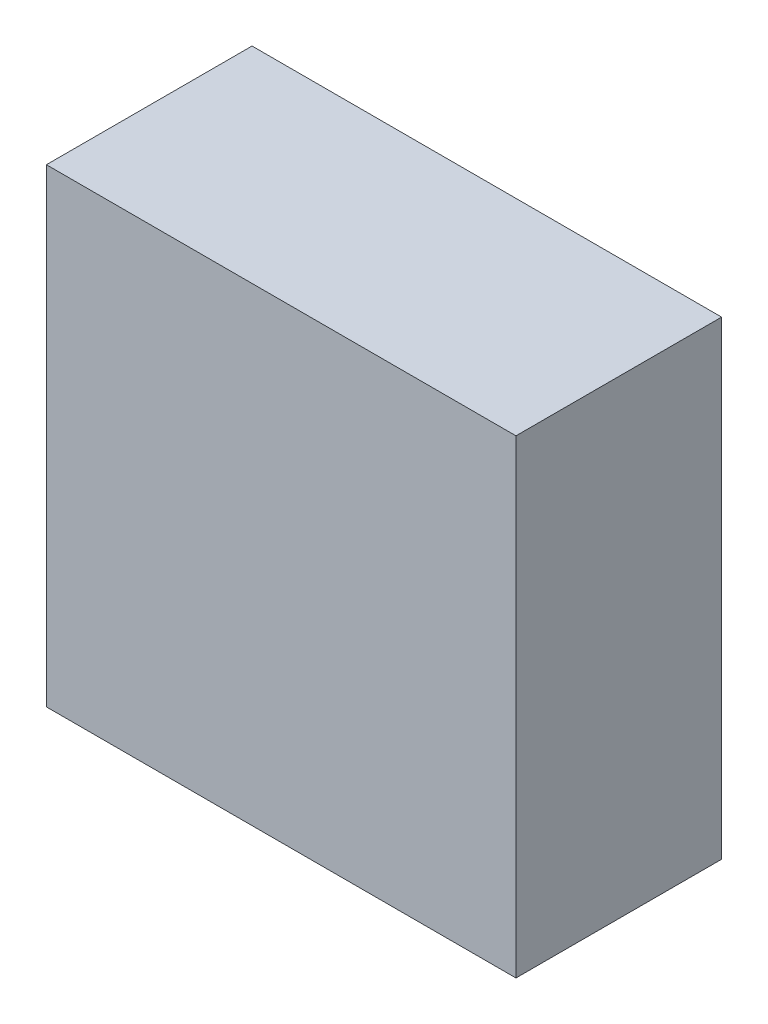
ISO-10303-21;
HEADER;
FILE_DESCRIPTION(('STEP AP214'),'2;1');
FILE_NAME('part.step','',(''),(''),'','','');
FILE_SCHEMA(('AUTOMOTIVE_DESIGN { 1 0 10303 214 1 1 1 1 }'));
ENDSEC;
DATA;
#1=APPLICATION_CONTEXT('core data for automotive mechanical design processes');
#2=APPLICATION_PROTOCOL_DEFINITION('international standard','automotive_design',2000,#1);
#3=PRODUCT_CONTEXT('',#1,'mechanical');
#4=PRODUCT('Part','Part','',(#3));
#5=PRODUCT_RELATED_PRODUCT_CATEGORY('part','',(#4));
#6=PRODUCT_DEFINITION_FORMATION('','',#4);
#7=PRODUCT_DEFINITION_CONTEXT('part definition',#1,'design');
#8=PRODUCT_DEFINITION('design','',#6,#7);
#9=PRODUCT_DEFINITION_SHAPE('','',#8);
#10=(LENGTH_UNIT() NAMED_UNIT(*) SI_UNIT(.MILLI.,.METRE.));
#11=(NAMED_UNIT(*) PLANE_ANGLE_UNIT() SI_UNIT($,.RADIAN.));
#12=(NAMED_UNIT(*) SI_UNIT($,.STERADIAN.) SOLID_ANGLE_UNIT());
#13=UNCERTAINTY_MEASURE_WITH_UNIT(LENGTH_MEASURE(1.E-05),#10,'distance_accuracy_value','');
#14=(GEOMETRIC_REPRESENTATION_CONTEXT(3) GLOBAL_UNCERTAINTY_ASSIGNED_CONTEXT((#13)) GLOBAL_UNIT_ASSIGNED_CONTEXT((#10,
#11,#12)) REPRESENTATION_CONTEXT('',''));
#15=CARTESIAN_POINT('',(0.,0.,0.));
#16=DIRECTION('',(0.,0.,1.));
#17=DIRECTION('',(1.,0.,0.));
#18=AXIS2_PLACEMENT_3D('',#15,#16,#17);
#19=CARTESIAN_POINT('',(15.4970354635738,15.875,0.));
#20=DIRECTION('',(1.,0.,0.));
#21=DIRECTION('',(0.,1.,0.));
#22=AXIS2_PLACEMENT_3D('',#19,#20,#21);
#23=PLANE('',#22);
#24=DIRECTION('',(0.,0.,1.));
#25=VECTOR('',#24,1.);
#26=CARTESIAN_POINT('',(15.4970354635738,15.875,0.));
#27=LINE('',#26,#25);
#28=CARTESIAN_POINT('',(15.4970354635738,15.875,0.));
#29=VERTEX_POINT('',#28);
#30=CARTESIAN_POINT('',(15.4970354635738,15.875,13.904));
#31=VERTEX_POINT('',#30);
#32=EDGE_CURVE('E17',#29,#31,#27,.T.);
#33=ORIENTED_EDGE('',*,*,#32,.T.);
#34=DIRECTION('',(0.,1.,0.));
#35=VECTOR('',#34,1.);
#36=CARTESIAN_POINT('',(15.4970354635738,-15.875,13.904));
#37=LINE('',#36,#35);
#38=CARTESIAN_POINT('',(15.4970354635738,-15.875,13.904));
#39=VERTEX_POINT('',#38);
#40=EDGE_CURVE('E58',#39,#31,#37,.T.);
#41=ORIENTED_EDGE('',*,*,#40,.F.);
#42=DIRECTION('',(0.,0.,1.));
#43=VECTOR('',#42,1.);
#44=CARTESIAN_POINT('',(15.4970354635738,-15.875,0.));
#45=LINE('',#44,#43);
#46=CARTESIAN_POINT('',(15.4970354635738,-15.875,0.));
#47=VERTEX_POINT('',#46);
#48=EDGE_CURVE('E9',#47,#39,#45,.T.);
#49=ORIENTED_EDGE('',*,*,#48,.F.);
#50=DIRECTION('',(0.,1.,0.));
#51=VECTOR('',#50,1.);
#52=CARTESIAN_POINT('',(15.4970354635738,15.875,0.));
#53=LINE('',#52,#51);
#54=EDGE_CURVE('E72',#47,#29,#53,.T.);
#55=ORIENTED_EDGE('',*,*,#54,.T.);
#56=EDGE_LOOP('',(#33,#41,#49,#55));
#57=FACE_BOUND('',#56,.T.);
#58=ADVANCED_FACE('F14',(#57),#23,.T.);
#59=CARTESIAN_POINT('',(-16.2529645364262,-15.875,0.));
#60=DIRECTION('',(0.,-1.,0.));
#61=DIRECTION('',(1.,0.,0.));
#62=AXIS2_PLACEMENT_3D('',#59,#60,#61);
#63=PLANE('',#62);
#64=ORIENTED_EDGE('',*,*,#48,.T.);
#65=DIRECTION('',(1.,0.,0.));
#66=VECTOR('',#65,1.);
#67=CARTESIAN_POINT('',(-16.2529645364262,-15.875,13.904));
#68=LINE('',#67,#66);
#69=CARTESIAN_POINT('',(-16.2529645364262,-15.875,13.904));
#70=VERTEX_POINT('',#69);
#71=EDGE_CURVE('E54',#70,#39,#68,.T.);
#72=ORIENTED_EDGE('',*,*,#71,.F.);
#73=DIRECTION('',(0.,0.,1.));
#74=VECTOR('',#73,1.);
#75=CARTESIAN_POINT('',(-16.2529645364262,-15.875,0.));
#76=LINE('',#75,#74);
#77=CARTESIAN_POINT('',(-16.2529645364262,-15.875,0.));
#78=VERTEX_POINT('',#77);
#79=EDGE_CURVE('E22',#78,#70,#76,.T.);
#80=ORIENTED_EDGE('',*,*,#79,.F.);
#81=DIRECTION('',(1.,0.,0.));
#82=VECTOR('',#81,1.);
#83=CARTESIAN_POINT('',(-16.2529645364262,-15.875,0.));
#84=LINE('',#83,#82);
#85=EDGE_CURVE('E56',#78,#47,#84,.T.);
#86=ORIENTED_EDGE('',*,*,#85,.T.);
#87=EDGE_LOOP('',(#64,#72,#80,#86));
#88=FACE_BOUND('',#87,.T.);
#89=ADVANCED_FACE('F52',(#88),#63,.T.);
#90=CARTESIAN_POINT('',(-16.2529645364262,15.875,0.));
#91=DIRECTION('',(-1.,0.,0.));
#92=DIRECTION('',(0.,-1.,0.));
#93=AXIS2_PLACEMENT_3D('',#90,#91,#92);
#94=PLANE('',#93);
#95=ORIENTED_EDGE('',*,*,#79,.T.);
#96=DIRECTION('',(0.,-1.,0.));
#97=VECTOR('',#96,1.);
#98=CARTESIAN_POINT('',(-16.2529645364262,15.875,13.904));
#99=LINE('',#98,#97);
#100=CARTESIAN_POINT('',(-16.2529645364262,15.875,13.904));
#101=VERTEX_POINT('',#100);
#102=EDGE_CURVE('E67',#101,#70,#99,.T.);
#103=ORIENTED_EDGE('',*,*,#102,.F.);
#104=DIRECTION('',(0.,0.,1.));
#105=VECTOR('',#104,1.);
#106=CARTESIAN_POINT('',(-16.2529645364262,15.875,0.));
#107=LINE('',#106,#105);
#108=CARTESIAN_POINT('',(-16.2529645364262,15.875,0.));
#109=VERTEX_POINT('',#108);
#110=EDGE_CURVE('E80',#109,#101,#107,.T.);
#111=ORIENTED_EDGE('',*,*,#110,.F.);
#112=DIRECTION('',(0.,-1.,0.));
#113=VECTOR('',#112,1.);
#114=CARTESIAN_POINT('',(-16.2529645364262,15.875,0.));
#115=LINE('',#114,#113);
#116=EDGE_CURVE('E77',#109,#78,#115,.T.);
#117=ORIENTED_EDGE('',*,*,#116,.T.);
#118=EDGE_LOOP('',(#95,#103,#111,#117));
#119=FACE_BOUND('',#118,.T.);
#120=ADVANCED_FACE('F86',(#119),#94,.T.);
#121=CARTESIAN_POINT('',(-16.2529645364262,15.875,0.));
#122=DIRECTION('',(0.,1.,0.));
#123=DIRECTION('',(-1.,0.,0.));
#124=AXIS2_PLACEMENT_3D('',#121,#122,#123);
#125=PLANE('',#124);
#126=ORIENTED_EDGE('',*,*,#110,.T.);
#127=DIRECTION('',(-1.,0.,0.));
#128=VECTOR('',#127,1.);
#129=CARTESIAN_POINT('',(15.4970354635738,15.875,13.904));
#130=LINE('',#129,#128);
#131=EDGE_CURVE('E62',#31,#101,#130,.T.);
#132=ORIENTED_EDGE('',*,*,#131,.F.);
#133=ORIENTED_EDGE('',*,*,#32,.F.);
#134=DIRECTION('',(-1.,0.,0.));
#135=VECTOR('',#134,1.);
#136=CARTESIAN_POINT('',(-16.2529645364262,15.875,0.));
#137=LINE('',#136,#135);
#138=EDGE_CURVE('E74',#29,#109,#137,.T.);
#139=ORIENTED_EDGE('',*,*,#138,.T.);
#140=EDGE_LOOP('',(#126,#132,#133,#139));
#141=FACE_BOUND('',#140,.T.);
#142=ADVANCED_FACE('F82',(#141),#125,.T.);
#143=CARTESIAN_POINT('',(-0.377964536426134,0.,0.));
#144=DIRECTION('',(0.,0.,1.));
#145=DIRECTION('',(0.,-1.,0.));
#146=AXIS2_PLACEMENT_3D('',#143,#144,#145);
#147=PLANE('',#146);
#148=ORIENTED_EDGE('',*,*,#54,.F.);
#149=ORIENTED_EDGE('',*,*,#85,.F.);
#150=ORIENTED_EDGE('',*,*,#116,.F.);
#151=ORIENTED_EDGE('',*,*,#138,.F.);
#152=EDGE_LOOP('',(#148,#149,#150,#151));
#153=FACE_BOUND('',#152,.T.);
#154=ADVANCED_FACE('F88',(#153),#147,.F.);
#155=CARTESIAN_POINT('',(0.,0.,13.904));
#156=DIRECTION('',(0.,0.,1.));
#157=DIRECTION('',(1.,0.,0.));
#158=AXIS2_PLACEMENT_3D('',#155,#156,#157);
#159=PLANE('',#158);
#160=ORIENTED_EDGE('',*,*,#71,.T.);
#161=ORIENTED_EDGE('',*,*,#40,.T.);
#162=ORIENTED_EDGE('',*,*,#131,.T.);
#163=ORIENTED_EDGE('',*,*,#102,.T.);
#164=EDGE_LOOP('',(#160,#161,#162,#163));
#165=FACE_BOUND('',#164,.T.);
#166=ADVANCED_FACE('F65',(#165),#159,.T.);
#167=CLOSED_SHELL('',(#58,#89,#120,#142,#154,#166));
#168=MANIFOLD_SOLID_BREP('B1',#167);
#169=ADVANCED_BREP_SHAPE_REPRESENTATION('',(#18,#168),#14);
#170=SHAPE_DEFINITION_REPRESENTATION(#9,#169);
ENDSEC;
END-ISO-10303-21;
